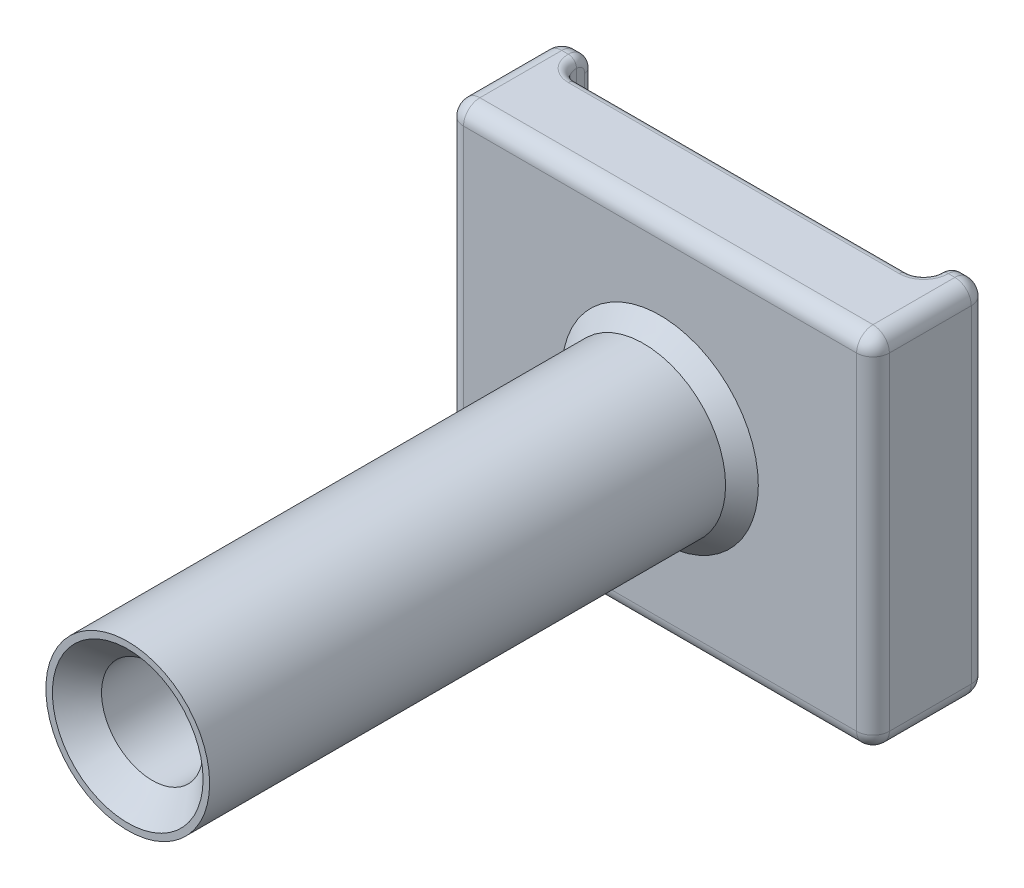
ISO-10303-21;
HEADER;
FILE_DESCRIPTION(('STEP AP214'),'2;1');
FILE_NAME('part.step','',(''),(''),'','','');
FILE_SCHEMA(('AUTOMOTIVE_DESIGN { 1 0 10303 214 1 1 1 1 }'));
ENDSEC;
DATA;
#1=APPLICATION_CONTEXT('core data for automotive mechanical design processes');
#2=APPLICATION_PROTOCOL_DEFINITION('international standard','automotive_design',2000,#1);
#3=PRODUCT_CONTEXT('',#1,'mechanical');
#4=PRODUCT('Part','Part','',(#3));
#5=PRODUCT_RELATED_PRODUCT_CATEGORY('part','',(#4));
#6=PRODUCT_DEFINITION_FORMATION('','',#4);
#7=PRODUCT_DEFINITION_CONTEXT('part definition',#1,'design');
#8=PRODUCT_DEFINITION('design','',#6,#7);
#9=PRODUCT_DEFINITION_SHAPE('','',#8);
#10=(LENGTH_UNIT() NAMED_UNIT(*) SI_UNIT(.MILLI.,.METRE.));
#11=(NAMED_UNIT(*) PLANE_ANGLE_UNIT() SI_UNIT($,.RADIAN.));
#12=(NAMED_UNIT(*) SI_UNIT($,.STERADIAN.) SOLID_ANGLE_UNIT());
#13=UNCERTAINTY_MEASURE_WITH_UNIT(LENGTH_MEASURE(1.E-05),#10,'distance_accuracy_value','');
#14=(GEOMETRIC_REPRESENTATION_CONTEXT(3) GLOBAL_UNCERTAINTY_ASSIGNED_CONTEXT((#13)) GLOBAL_UNIT_ASSIGNED_CONTEXT((#10,
#11,#12)) REPRESENTATION_CONTEXT('',''));
#15=CARTESIAN_POINT('',(0.,0.,0.));
#16=DIRECTION('',(0.,0.,1.));
#17=DIRECTION('',(1.,0.,0.));
#18=AXIS2_PLACEMENT_3D('',#15,#16,#17);
#19=CARTESIAN_POINT('',(-13.,-11.,5.));
#20=DIRECTION('',(0.,0.,1.));
#21=DIRECTION('',(1.,0.,0.));
#22=AXIS2_PLACEMENT_3D('',#19,#20,#21);
#23=PLANE('',#22);
#24=CARTESIAN_POINT('',(0.,0.,5.));
#25=DIRECTION('',(0.,0.,1.));
#26=DIRECTION('',(1.,0.,0.));
#27=AXIS2_PLACEMENT_3D('',#24,#25,#26);
#28=CIRCLE('',#27,6.);
#29=CARTESIAN_POINT('',(6.,0.,5.));
#30=VERTEX_POINT('',#29);
#31=EDGE_CURVE('E332',#30,#30,#28,.F.);
#32=ORIENTED_EDGE('',*,*,#31,.T.);
#33=EDGE_LOOP('',(#32));
#34=FACE_BOUND('',#33,.T.);
#35=DIRECTION('',(0.,1.,0.));
#36=VECTOR('',#35,1.);
#37=CARTESIAN_POINT('',(12.,11.,5.));
#38=LINE('',#37,#36);
#39=CARTESIAN_POINT('',(12.,-10.,5.));
#40=VERTEX_POINT('',#39);
#41=CARTESIAN_POINT('',(12.,10.,5.));
#42=VERTEX_POINT('',#41);
#43=EDGE_CURVE('E211',#40,#42,#38,.T.);
#44=ORIENTED_EDGE('',*,*,#43,.T.);
#45=DIRECTION('',(-1.,0.,0.));
#46=VECTOR('',#45,1.);
#47=CARTESIAN_POINT('',(-13.,10.,5.));
#48=LINE('',#47,#46);
#49=CARTESIAN_POINT('',(-12.,10.,5.));
#50=VERTEX_POINT('',#49);
#51=EDGE_CURVE('E182',#42,#50,#48,.T.);
#52=ORIENTED_EDGE('',*,*,#51,.T.);
#53=DIRECTION('',(0.,-1.,0.));
#54=VECTOR('',#53,1.);
#55=CARTESIAN_POINT('',(-12.,-11.,5.));
#56=LINE('',#55,#54);
#57=CARTESIAN_POINT('',(-12.,-10.,5.));
#58=VERTEX_POINT('',#57);
#59=EDGE_CURVE('E201',#50,#58,#56,.T.);
#60=ORIENTED_EDGE('',*,*,#59,.T.);
#61=DIRECTION('',(1.,0.,0.));
#62=VECTOR('',#61,1.);
#63=CARTESIAN_POINT('',(13.,-10.,5.));
#64=LINE('',#63,#62);
#65=EDGE_CURVE('E207',#58,#40,#64,.T.);
#66=ORIENTED_EDGE('',*,*,#65,.T.);
#67=EDGE_LOOP('',(#44,#52,#60,#66));
#68=FACE_BOUND('',#67,.T.);
#69=ADVANCED_FACE('F17',(#34,#68),#23,.T.);
#70=CARTESIAN_POINT('',(-13.,-11.,0.));
#71=DIRECTION('',(0.,0.,1.));
#72=DIRECTION('',(1.,0.,0.));
#73=AXIS2_PLACEMENT_3D('',#70,#71,#72);
#74=PLANE('',#73);
#75=CARTESIAN_POINT('',(0.,0.,0.));
#76=DIRECTION('',(0.,0.,1.));
#77=DIRECTION('',(1.,0.,0.));
#78=AXIS2_PLACEMENT_3D('',#75,#76,#77);
#79=CIRCLE('',#78,3.1);
#80=CARTESIAN_POINT('',(3.1,0.,0.));
#81=VERTEX_POINT('',#80);
#82=EDGE_CURVE('E208',#81,#81,#79,.T.);
#83=ORIENTED_EDGE('',*,*,#82,.T.);
#84=EDGE_LOOP('',(#83));
#85=FACE_BOUND('',#84,.T.);
#86=DIRECTION('',(0.,1.,0.));
#87=VECTOR('',#86,1.);
#88=CARTESIAN_POINT('',(10.1,-11.,0.));
#89=LINE('',#88,#87);
#90=CARTESIAN_POINT('',(10.1,10.5,0.));
#91=VERTEX_POINT('',#90);
#92=CARTESIAN_POINT('',(10.1,-10.5,0.));
#93=VERTEX_POINT('',#92);
#94=EDGE_CURVE('E272',#91,#93,#89,.F.);
#95=ORIENTED_EDGE('',*,*,#94,.T.);
#96=DIRECTION('',(1.,0.,0.));
#97=VECTOR('',#96,1.);
#98=CARTESIAN_POINT('',(-13.,-10.5,0.));
#99=LINE('',#98,#97);
#100=CARTESIAN_POINT('',(-10.1,-10.5,0.));
#101=VERTEX_POINT('',#100);
#102=EDGE_CURVE('E290',#93,#101,#99,.F.);
#103=ORIENTED_EDGE('',*,*,#102,.T.);
#104=DIRECTION('',(0.,-1.,0.));
#105=VECTOR('',#104,1.);
#106=CARTESIAN_POINT('',(-10.1,11.,0.));
#107=LINE('',#106,#105);
#108=CARTESIAN_POINT('',(-10.1,10.5,0.));
#109=VERTEX_POINT('',#108);
#110=EDGE_CURVE('E275',#101,#109,#107,.F.);
#111=ORIENTED_EDGE('',*,*,#110,.T.);
#112=DIRECTION('',(-1.,0.,0.));
#113=VECTOR('',#112,1.);
#114=CARTESIAN_POINT('',(-13.,10.5,0.));
#115=LINE('',#114,#113);
#116=EDGE_CURVE('E288',#109,#91,#115,.F.);
#117=ORIENTED_EDGE('',*,*,#116,.T.);
#118=EDGE_LOOP('',(#95,#103,#111,#117));
#119=FACE_BOUND('',#118,.T.);
#120=ADVANCED_FACE('F355',(#85,#119),#74,.F.);
#121=CARTESIAN_POINT('',(-13.,11.,5.));
#122=DIRECTION('',(1.,0.,0.));
#123=DIRECTION('',(0.,1.,0.));
#124=AXIS2_PLACEMENT_3D('',#121,#122,#123);
#125=PLANE('',#124);
#126=DIRECTION('',(0.,0.,-1.));
#127=VECTOR('',#126,1.);
#128=CARTESIAN_POINT('',(-13.,-10.,5.));
#129=LINE('',#128,#127);
#130=CARTESIAN_POINT('',(-13.,-10.,-1.));
#131=VERTEX_POINT('',#130);
#132=CARTESIAN_POINT('',(-13.,-10.,4.));
#133=VERTEX_POINT('',#132);
#134=EDGE_CURVE('E248',#131,#133,#129,.F.);
#135=ORIENTED_EDGE('',*,*,#134,.T.);
#136=DIRECTION('',(0.,-1.,0.));
#137=VECTOR('',#136,1.);
#138=CARTESIAN_POINT('',(-13.,11.,4.));
#139=LINE('',#138,#137);
#140=CARTESIAN_POINT('',(-13.,10.,4.));
#141=VERTEX_POINT('',#140);
#142=EDGE_CURVE('E252',#133,#141,#139,.F.);
#143=ORIENTED_EDGE('',*,*,#142,.T.);
#144=DIRECTION('',(0.,0.,-1.));
#145=VECTOR('',#144,1.);
#146=CARTESIAN_POINT('',(-13.,10.,5.));
#147=LINE('',#146,#145);
#148=CARTESIAN_POINT('',(-13.,10.,-1.));
#149=VERTEX_POINT('',#148);
#150=EDGE_CURVE('E250',#141,#149,#147,.T.);
#151=ORIENTED_EDGE('',*,*,#150,.T.);
#152=DIRECTION('',(0.,1.,0.));
#153=VECTOR('',#152,1.);
#154=CARTESIAN_POINT('',(-13.,-11.,-1.));
#155=LINE('',#154,#153);
#156=EDGE_CURVE('E246',#149,#131,#155,.F.);
#157=ORIENTED_EDGE('',*,*,#156,.T.);
#158=EDGE_LOOP('',(#135,#143,#151,#157));
#159=FACE_BOUND('',#158,.T.);
#160=ADVANCED_FACE('F19',(#159),#125,.F.);
#161=CARTESIAN_POINT('',(-13.,-11.,5.));
#162=DIRECTION('',(0.,1.,0.));
#163=DIRECTION('',(-1.,0.,0.));
#164=AXIS2_PLACEMENT_3D('',#161,#162,#163);
#165=PLANE('',#164);
#166=DIRECTION('',(1.,0.,0.));
#167=VECTOR('',#166,1.);
#168=CARTESIAN_POINT('',(-13.,-11.,0.5));
#169=LINE('',#168,#167);
#170=CARTESIAN_POINT('',(-10.1,-11.,0.5));
#171=VERTEX_POINT('',#170);
#172=CARTESIAN_POINT('',(10.1,-11.,0.5));
#173=VERTEX_POINT('',#172);
#174=EDGE_CURVE('E283',#171,#173,#169,.T.);
#175=ORIENTED_EDGE('',*,*,#174,.T.);
#176=CARTESIAN_POINT('',(10.1,-11.,-1.));
#177=DIRECTION('',(0.,1.,0.));
#178=DIRECTION('',(-1.,0.,0.));
#179=AXIS2_PLACEMENT_3D('',#176,#177,#178);
#180=CIRCLE('',#179,1.5);
#181=CARTESIAN_POINT('',(11.6,-11.,-1.));
#182=VERTEX_POINT('',#181);
#183=EDGE_CURVE('E286',#173,#182,#180,.T.);
#184=ORIENTED_EDGE('',*,*,#183,.T.);
#185=DIRECTION('',(-1.,0.,0.));
#186=VECTOR('',#185,1.);
#187=CARTESIAN_POINT('',(13.,-11.,-1.));
#188=LINE('',#187,#186);
#189=CARTESIAN_POINT('',(12.,-11.,-1.));
#190=VERTEX_POINT('',#189);
#191=EDGE_CURVE('E244',#182,#190,#188,.F.);
#192=ORIENTED_EDGE('',*,*,#191,.T.);
#193=DIRECTION('',(0.,0.,-1.));
#194=VECTOR('',#193,1.);
#195=CARTESIAN_POINT('',(12.,-11.,5.));
#196=LINE('',#195,#194);
#197=CARTESIAN_POINT('',(12.,-11.,4.));
#198=VERTEX_POINT('',#197);
#199=EDGE_CURVE('E242',#190,#198,#196,.F.);
#200=ORIENTED_EDGE('',*,*,#199,.T.);
#201=DIRECTION('',(1.,0.,0.));
#202=VECTOR('',#201,1.);
#203=CARTESIAN_POINT('',(-13.,-11.,4.));
#204=LINE('',#203,#202);
#205=CARTESIAN_POINT('',(-12.,-11.,4.));
#206=VERTEX_POINT('',#205);
#207=EDGE_CURVE('E240',#198,#206,#204,.F.);
#208=ORIENTED_EDGE('',*,*,#207,.T.);
#209=DIRECTION('',(0.,0.,-1.));
#210=VECTOR('',#209,1.);
#211=CARTESIAN_POINT('',(-12.,-11.,5.));
#212=LINE('',#211,#210);
#213=CARTESIAN_POINT('',(-12.,-11.,-1.));
#214=VERTEX_POINT('',#213);
#215=EDGE_CURVE('E235',#206,#214,#212,.T.);
#216=ORIENTED_EDGE('',*,*,#215,.T.);
#217=DIRECTION('',(-1.,0.,0.));
#218=VECTOR('',#217,1.);
#219=CARTESIAN_POINT('',(-11.1,-11.,-1.));
#220=LINE('',#219,#218);
#221=CARTESIAN_POINT('',(-11.6,-11.,-1.));
#222=VERTEX_POINT('',#221);
#223=EDGE_CURVE('E237',#214,#222,#220,.F.);
#224=ORIENTED_EDGE('',*,*,#223,.T.);
#225=CARTESIAN_POINT('',(-10.1,-11.,-1.));
#226=DIRECTION('',(0.,1.,0.));
#227=DIRECTION('',(-1.,0.,0.));
#228=AXIS2_PLACEMENT_3D('',#225,#226,#227);
#229=CIRCLE('',#228,1.5);
#230=EDGE_CURVE('E281',#222,#171,#229,.T.);
#231=ORIENTED_EDGE('',*,*,#230,.T.);
#232=EDGE_LOOP('',(#175,#184,#192,#200,#208,#216,#224,#231));
#233=FACE_BOUND('',#232,.T.);
#234=ADVANCED_FACE('F371',(#233),#165,.F.);
#235=CARTESIAN_POINT('',(13.,11.,5.));
#236=DIRECTION('',(-1.,0.,0.));
#237=DIRECTION('',(0.,0.,1.));
#238=AXIS2_PLACEMENT_3D('',#235,#236,#237);
#239=PLANE('',#238);
#240=DIRECTION('',(0.,0.,-1.));
#241=VECTOR('',#240,1.);
#242=CARTESIAN_POINT('',(13.,10.,5.));
#243=LINE('',#242,#241);
#244=CARTESIAN_POINT('',(13.,10.,-1.));
#245=VERTEX_POINT('',#244);
#246=CARTESIAN_POINT('',(13.,10.,4.));
#247=VERTEX_POINT('',#246);
#248=EDGE_CURVE('E230',#245,#247,#243,.F.);
#249=ORIENTED_EDGE('',*,*,#248,.T.);
#250=DIRECTION('',(0.,1.,0.));
#251=VECTOR('',#250,1.);
#252=CARTESIAN_POINT('',(13.,-11.,4.));
#253=LINE('',#252,#251);
#254=CARTESIAN_POINT('',(13.,-10.,4.));
#255=VERTEX_POINT('',#254);
#256=EDGE_CURVE('E232',#247,#255,#253,.F.);
#257=ORIENTED_EDGE('',*,*,#256,.T.);
#258=DIRECTION('',(0.,0.,-1.));
#259=VECTOR('',#258,1.);
#260=CARTESIAN_POINT('',(13.,-10.,5.));
#261=LINE('',#260,#259);
#262=CARTESIAN_POINT('',(13.,-10.,-1.));
#263=VERTEX_POINT('',#262);
#264=EDGE_CURVE('E228',#255,#263,#261,.T.);
#265=ORIENTED_EDGE('',*,*,#264,.T.);
#266=DIRECTION('',(0.,-1.,0.));
#267=VECTOR('',#266,1.);
#268=CARTESIAN_POINT('',(13.,11.,-1.));
#269=LINE('',#268,#267);
#270=EDGE_CURVE('E226',#263,#245,#269,.F.);
#271=ORIENTED_EDGE('',*,*,#270,.T.);
#272=EDGE_LOOP('',(#249,#257,#265,#271));
#273=FACE_BOUND('',#272,.T.);
#274=ADVANCED_FACE('F369',(#273),#239,.F.);
#275=CARTESIAN_POINT('',(-13.,11.,5.));
#276=DIRECTION('',(0.,-1.,0.));
#277=DIRECTION('',(1.,0.,0.));
#278=AXIS2_PLACEMENT_3D('',#275,#276,#277);
#279=PLANE('',#278);
#280=DIRECTION('',(1.,0.,0.));
#281=VECTOR('',#280,1.);
#282=CARTESIAN_POINT('',(11.1,11.,-1.));
#283=LINE('',#282,#281);
#284=CARTESIAN_POINT('',(12.,11.,-1.));
#285=VERTEX_POINT('',#284);
#286=CARTESIAN_POINT('',(11.6,11.,-1.));
#287=VERTEX_POINT('',#286);
#288=EDGE_CURVE('E224',#285,#287,#283,.F.);
#289=ORIENTED_EDGE('',*,*,#288,.T.);
#290=CARTESIAN_POINT('',(10.1,11.,-1.));
#291=DIRECTION('',(0.,-1.,0.));
#292=DIRECTION('',(1.,0.,0.));
#293=AXIS2_PLACEMENT_3D('',#290,#291,#292);
#294=CIRCLE('',#293,1.5);
#295=CARTESIAN_POINT('',(10.1,11.,0.5));
#296=VERTEX_POINT('',#295);
#297=EDGE_CURVE('E37',#287,#296,#294,.T.);
#298=ORIENTED_EDGE('',*,*,#297,.T.);
#299=DIRECTION('',(-1.,0.,0.));
#300=VECTOR('',#299,1.);
#301=CARTESIAN_POINT('',(-13.,11.,0.5));
#302=LINE('',#301,#300);
#303=CARTESIAN_POINT('',(-10.1,11.,0.5));
#304=VERTEX_POINT('',#303);
#305=EDGE_CURVE('E32',#296,#304,#302,.T.);
#306=ORIENTED_EDGE('',*,*,#305,.T.);
#307=CARTESIAN_POINT('',(-10.1,11.,-1.));
#308=DIRECTION('',(0.,-1.,0.));
#309=DIRECTION('',(1.,0.,0.));
#310=AXIS2_PLACEMENT_3D('',#307,#308,#309);
#311=CIRCLE('',#310,1.5);
#312=CARTESIAN_POINT('',(-11.6,11.,-1.));
#313=VERTEX_POINT('',#312);
#314=EDGE_CURVE('E326',#304,#313,#311,.T.);
#315=ORIENTED_EDGE('',*,*,#314,.T.);
#316=DIRECTION('',(1.,0.,0.));
#317=VECTOR('',#316,1.);
#318=CARTESIAN_POINT('',(-13.,11.,-1.));
#319=LINE('',#318,#317);
#320=CARTESIAN_POINT('',(-12.,11.,-1.));
#321=VERTEX_POINT('',#320);
#322=EDGE_CURVE('E215',#313,#321,#319,.F.);
#323=ORIENTED_EDGE('',*,*,#322,.T.);
#324=DIRECTION('',(0.,0.,-1.));
#325=VECTOR('',#324,1.);
#326=CARTESIAN_POINT('',(-12.,11.,5.));
#327=LINE('',#326,#325);
#328=CARTESIAN_POINT('',(-12.,11.,4.));
#329=VERTEX_POINT('',#328);
#330=EDGE_CURVE('E213',#321,#329,#327,.F.);
#331=ORIENTED_EDGE('',*,*,#330,.T.);
#332=DIRECTION('',(-1.,0.,0.));
#333=VECTOR('',#332,1.);
#334=CARTESIAN_POINT('',(13.,11.,4.));
#335=LINE('',#334,#333);
#336=CARTESIAN_POINT('',(12.,11.,4.));
#337=VERTEX_POINT('',#336);
#338=EDGE_CURVE('E184',#329,#337,#335,.F.);
#339=ORIENTED_EDGE('',*,*,#338,.T.);
#340=DIRECTION('',(0.,0.,-1.));
#341=VECTOR('',#340,1.);
#342=CARTESIAN_POINT('',(12.,11.,5.));
#343=LINE('',#342,#341);
#344=EDGE_CURVE('E222',#337,#285,#343,.T.);
#345=ORIENTED_EDGE('',*,*,#344,.T.);
#346=EDGE_LOOP('',(#289,#298,#306,#315,#323,#331,#339,#345));
#347=FACE_BOUND('',#346,.T.);
#348=ADVANCED_FACE('F366',(#347),#279,.F.);
#349=CARTESIAN_POINT('',(0.,0.,5.));
#350=DIRECTION('',(0.,0.,-1.));
#351=DIRECTION('',(-1.,0.,0.));
#352=AXIS2_PLACEMENT_3D('',#349,#350,#351);
#353=CYLINDRICAL_SURFACE('',#352,3.1);
#354=CARTESIAN_POINT('',(0.,0.,36.));
#355=DIRECTION('',(0.,0.,1.));
#356=DIRECTION('',(1.,0.,0.));
#357=AXIS2_PLACEMENT_3D('',#354,#355,#356);
#358=CIRCLE('',#357,3.1);
#359=CARTESIAN_POINT('',(3.1,0.,36.));
#360=VERTEX_POINT('',#359);
#361=EDGE_CURVE('E25',#360,#360,#358,.T.);
#362=ORIENTED_EDGE('',*,*,#361,.T.);
#363=EDGE_LOOP('',(#362));
#364=FACE_BOUND('',#363,.T.);
#365=ORIENTED_EDGE('',*,*,#82,.F.);
#366=EDGE_LOOP('',(#365));
#367=FACE_BOUND('',#366,.T.);
#368=ADVANCED_FACE('F337',(#364,#367),#353,.F.);
#369=CARTESIAN_POINT('',(-11.1,11.,-2.));
#370=DIRECTION('',(-1.,0.,0.));
#371=DIRECTION('',(0.,-1.,0.));
#372=AXIS2_PLACEMENT_3D('',#369,#370,#371);
#373=PLANE('',#372);
#374=DIRECTION('',(0.,-1.,0.));
#375=VECTOR('',#374,1.);
#376=CARTESIAN_POINT('',(-11.1,-11.,-1.));
#377=LINE('',#376,#375);
#378=CARTESIAN_POINT('',(-11.1,10.5,-1.));
#379=VERTEX_POINT('',#378);
#380=CARTESIAN_POINT('',(-11.1,-10.5,-1.));
#381=VERTEX_POINT('',#380);
#382=EDGE_CURVE('E269',#379,#381,#377,.T.);
#383=ORIENTED_EDGE('',*,*,#382,.T.);
#384=CARTESIAN_POINT('',(-11.1,-10.,-1.));
#385=DIRECTION('',(-1.,0.,0.));
#386=DIRECTION('',(0.,-1.,0.));
#387=AXIS2_PLACEMENT_3D('',#384,#385,#386);
#388=CIRCLE('',#387,0.5);
#389=CARTESIAN_POINT('',(-11.1,-10.,-1.5));
#390=VERTEX_POINT('',#389);
#391=EDGE_CURVE('E313',#381,#390,#388,.F.);
#392=ORIENTED_EDGE('',*,*,#391,.T.);
#393=DIRECTION('',(0.,-1.,0.));
#394=VECTOR('',#393,1.);
#395=CARTESIAN_POINT('',(-11.1,10.,-1.5));
#396=LINE('',#395,#394);
#397=CARTESIAN_POINT('',(-11.1,10.,-1.5));
#398=VERTEX_POINT('',#397);
#399=EDGE_CURVE('E311',#390,#398,#396,.F.);
#400=ORIENTED_EDGE('',*,*,#399,.T.);
#401=CARTESIAN_POINT('',(-11.1,10.,-1.));
#402=DIRECTION('',(-1.,0.,0.));
#403=DIRECTION('',(0.,-1.,0.));
#404=AXIS2_PLACEMENT_3D('',#401,#402,#403);
#405=CIRCLE('',#404,0.5);
#406=EDGE_CURVE('E309',#398,#379,#405,.F.);
#407=ORIENTED_EDGE('',*,*,#406,.T.);
#408=EDGE_LOOP('',(#383,#392,#400,#407));
#409=FACE_BOUND('',#408,.T.);
#410=ADVANCED_FACE('F596',(#409),#373,.F.);
#411=CARTESIAN_POINT('',(-13.,11.,-2.));
#412=DIRECTION('',(0.,0.,-1.));
#413=DIRECTION('',(-1.,0.,0.));
#414=AXIS2_PLACEMENT_3D('',#411,#412,#413);
#415=PLANE('',#414);
#416=DIRECTION('',(1.,0.,0.));
#417=VECTOR('',#416,1.);
#418=CARTESIAN_POINT('',(-11.1,10.,-2.));
#419=LINE('',#418,#417);
#420=CARTESIAN_POINT('',(-12.,10.,-2.));
#421=VERTEX_POINT('',#420);
#422=CARTESIAN_POINT('',(-11.6,10.,-2.));
#423=VERTEX_POINT('',#422);
#424=EDGE_CURVE('E259',#421,#423,#419,.T.);
#425=ORIENTED_EDGE('',*,*,#424,.T.);
#426=DIRECTION('',(0.,-1.,0.));
#427=VECTOR('',#426,1.);
#428=CARTESIAN_POINT('',(-11.6,-10.,-2.));
#429=LINE('',#428,#427);
#430=CARTESIAN_POINT('',(-11.6,-10.,-2.));
#431=VERTEX_POINT('',#430);
#432=EDGE_CURVE('E319',#423,#431,#429,.T.);
#433=ORIENTED_EDGE('',*,*,#432,.T.);
#434=DIRECTION('',(-1.,0.,0.));
#435=VECTOR('',#434,1.);
#436=CARTESIAN_POINT('',(-13.,-10.,-2.));
#437=LINE('',#436,#435);
#438=CARTESIAN_POINT('',(-12.,-10.,-2.));
#439=VERTEX_POINT('',#438);
#440=EDGE_CURVE('E257',#431,#439,#437,.T.);
#441=ORIENTED_EDGE('',*,*,#440,.T.);
#442=DIRECTION('',(0.,1.,0.));
#443=VECTOR('',#442,1.);
#444=CARTESIAN_POINT('',(-12.,11.,-2.));
#445=LINE('',#444,#443);
#446=EDGE_CURVE('E255',#439,#421,#445,.T.);
#447=ORIENTED_EDGE('',*,*,#446,.T.);
#448=EDGE_LOOP('',(#425,#433,#441,#447));
#449=FACE_BOUND('',#448,.T.);
#450=ADVANCED_FACE('F592',(#449),#415,.T.);
#451=CARTESIAN_POINT('',(11.1,-11.,-2.));
#452=DIRECTION('',(1.,0.,0.));
#453=DIRECTION('',(0.,0.,-1.));
#454=AXIS2_PLACEMENT_3D('',#451,#452,#453);
#455=PLANE('',#454);
#456=DIRECTION('',(0.,1.,0.));
#457=VECTOR('',#456,1.);
#458=CARTESIAN_POINT('',(11.1,-10.,-1.5));
#459=LINE('',#458,#457);
#460=CARTESIAN_POINT('',(11.1,10.,-1.5));
#461=VERTEX_POINT('',#460);
#462=CARTESIAN_POINT('',(11.1,-10.,-1.5));
#463=VERTEX_POINT('',#462);
#464=EDGE_CURVE('E303',#461,#463,#459,.F.);
#465=ORIENTED_EDGE('',*,*,#464,.T.);
#466=CARTESIAN_POINT('',(11.1,-10.,-1.));
#467=DIRECTION('',(1.,0.,0.));
#468=DIRECTION('',(0.,0.,-1.));
#469=AXIS2_PLACEMENT_3D('',#466,#467,#468);
#470=CIRCLE('',#469,0.5);
#471=CARTESIAN_POINT('',(11.1,-10.5,-1.));
#472=VERTEX_POINT('',#471);
#473=EDGE_CURVE('E305',#463,#472,#470,.F.);
#474=ORIENTED_EDGE('',*,*,#473,.T.);
#475=DIRECTION('',(0.,1.,0.));
#476=VECTOR('',#475,1.);
#477=CARTESIAN_POINT('',(11.1,11.,-1.));
#478=LINE('',#477,#476);
#479=CARTESIAN_POINT('',(11.1,10.5,-1.));
#480=VERTEX_POINT('',#479);
#481=EDGE_CURVE('E278',#472,#480,#478,.T.);
#482=ORIENTED_EDGE('',*,*,#481,.T.);
#483=CARTESIAN_POINT('',(11.1,10.,-1.));
#484=DIRECTION('',(1.,0.,0.));
#485=DIRECTION('',(0.,0.,-1.));
#486=AXIS2_PLACEMENT_3D('',#483,#484,#485);
#487=CIRCLE('',#486,0.5);
#488=EDGE_CURVE('E301',#480,#461,#487,.F.);
#489=ORIENTED_EDGE('',*,*,#488,.T.);
#490=EDGE_LOOP('',(#465,#474,#482,#489));
#491=FACE_BOUND('',#490,.T.);
#492=ADVANCED_FACE('F588',(#491),#455,.F.);
#493=CARTESIAN_POINT('',(11.1,-11.,-2.));
#494=DIRECTION('',(0.,0.,-1.));
#495=DIRECTION('',(-1.,0.,0.));
#496=AXIS2_PLACEMENT_3D('',#493,#494,#495);
#497=PLANE('',#496);
#498=DIRECTION('',(-1.,0.,0.));
#499=VECTOR('',#498,1.);
#500=CARTESIAN_POINT('',(11.1,-10.,-2.));
#501=LINE('',#500,#499);
#502=CARTESIAN_POINT('',(12.,-10.,-2.));
#503=VERTEX_POINT('',#502);
#504=CARTESIAN_POINT('',(11.6,-10.,-2.));
#505=VERTEX_POINT('',#504);
#506=EDGE_CURVE('E266',#503,#505,#501,.T.);
#507=ORIENTED_EDGE('',*,*,#506,.T.);
#508=DIRECTION('',(0.,1.,0.));
#509=VECTOR('',#508,1.);
#510=CARTESIAN_POINT('',(11.6,10.,-2.));
#511=LINE('',#510,#509);
#512=CARTESIAN_POINT('',(11.6,10.,-2.));
#513=VERTEX_POINT('',#512);
#514=EDGE_CURVE('E317',#505,#513,#511,.T.);
#515=ORIENTED_EDGE('',*,*,#514,.T.);
#516=DIRECTION('',(1.,0.,0.));
#517=VECTOR('',#516,1.);
#518=CARTESIAN_POINT('',(13.,10.,-2.));
#519=LINE('',#518,#517);
#520=CARTESIAN_POINT('',(12.,10.,-2.));
#521=VERTEX_POINT('',#520);
#522=EDGE_CURVE('E264',#513,#521,#519,.T.);
#523=ORIENTED_EDGE('',*,*,#522,.T.);
#524=DIRECTION('',(0.,-1.,0.));
#525=VECTOR('',#524,1.);
#526=CARTESIAN_POINT('',(12.,-11.,-2.));
#527=LINE('',#526,#525);
#528=EDGE_CURVE('E262',#521,#503,#527,.T.);
#529=ORIENTED_EDGE('',*,*,#528,.T.);
#530=EDGE_LOOP('',(#507,#515,#523,#529));
#531=FACE_BOUND('',#530,.T.);
#532=ADVANCED_FACE('F584',(#531),#497,.T.);
#533=CARTESIAN_POINT('',(11.1,-10.,-1.));
#534=DIRECTION('',(1.,0.,0.));
#535=DIRECTION('',(0.,1.,0.));
#536=AXIS2_PLACEMENT_3D('',#533,#534,#535);
#537=CYLINDRICAL_SURFACE('',#536,1.);
#538=ORIENTED_EDGE('',*,*,#191,.F.);
#539=CARTESIAN_POINT('',(11.6,-10.,-1.));
#540=DIRECTION('',(1.,0.,0.));
#541=DIRECTION('',(0.,0.,-1.));
#542=AXIS2_PLACEMENT_3D('',#539,#540,#541);
#543=CIRCLE('',#542,1.);
#544=EDGE_CURVE('E307',#182,#505,#543,.T.);
#545=ORIENTED_EDGE('',*,*,#544,.T.);
#546=ORIENTED_EDGE('',*,*,#506,.F.);
#547=CARTESIAN_POINT('',(12.,-10.,-1.));
#548=DIRECTION('',(1.,0.,0.));
#549=DIRECTION('',(0.,0.,-1.));
#550=AXIS2_PLACEMENT_3D('',#547,#548,#549);
#551=CIRCLE('',#550,1.);
#552=EDGE_CURVE('E487',#190,#503,#551,.T.);
#553=ORIENTED_EDGE('',*,*,#552,.F.);
#554=EDGE_LOOP('',(#538,#545,#546,#553));
#555=FACE_BOUND('',#554,.T.);
#556=ADVANCED_FACE('F580',(#555),#537,.T.);
#557=CARTESIAN_POINT('',(-13.,-10.,-1.));
#558=DIRECTION('',(1.,0.,0.));
#559=DIRECTION('',(0.,1.,0.));
#560=AXIS2_PLACEMENT_3D('',#557,#558,#559);
#561=CYLINDRICAL_SURFACE('',#560,1.);
#562=ORIENTED_EDGE('',*,*,#440,.F.);
#563=CARTESIAN_POINT('',(-11.6,-10.,-1.));
#564=DIRECTION('',(-1.,0.,0.));
#565=DIRECTION('',(0.,-1.,0.));
#566=AXIS2_PLACEMENT_3D('',#563,#564,#565);
#567=CIRCLE('',#566,1.);
#568=EDGE_CURVE('E315',#431,#222,#567,.T.);
#569=ORIENTED_EDGE('',*,*,#568,.T.);
#570=ORIENTED_EDGE('',*,*,#223,.F.);
#571=CARTESIAN_POINT('',(-12.,-10.,-1.));
#572=DIRECTION('',(-1.,0.,0.));
#573=DIRECTION('',(0.,0.,1.));
#574=AXIS2_PLACEMENT_3D('',#571,#572,#573);
#575=CIRCLE('',#574,1.);
#576=EDGE_CURVE('E484',#439,#214,#575,.T.);
#577=ORIENTED_EDGE('',*,*,#576,.F.);
#578=EDGE_LOOP('',(#562,#569,#570,#577));
#579=FACE_BOUND('',#578,.T.);
#580=ADVANCED_FACE('F576',(#579),#561,.T.);
#581=CARTESIAN_POINT('',(12.,-10.,-1.));
#582=DIRECTION('',(0.,0.,1.));
#583=DIRECTION('',(1.,0.,0.));
#584=AXIS2_PLACEMENT_3D('',#581,#582,#583);
#585=SPHERICAL_SURFACE('',#584,1.);
#586=CARTESIAN_POINT('',(12.,-10.,-1.));
#587=DIRECTION('',(0.,0.,-1.));
#588=DIRECTION('',(-1.,0.,0.));
#589=AXIS2_PLACEMENT_3D('',#586,#587,#588);
#590=CIRCLE('',#589,1.);
#591=EDGE_CURVE('E478',#190,#263,#590,.F.);
#592=ORIENTED_EDGE('',*,*,#591,.F.);
#593=ORIENTED_EDGE('',*,*,#552,.T.);
#594=CARTESIAN_POINT('',(12.,-10.,-1.));
#595=DIRECTION('',(0.,-1.,0.));
#596=DIRECTION('',(1.,0.,0.));
#597=AXIS2_PLACEMENT_3D('',#594,#595,#596);
#598=CIRCLE('',#597,1.);
#599=EDGE_CURVE('E481',#263,#503,#598,.F.);
#600=ORIENTED_EDGE('',*,*,#599,.F.);
#601=EDGE_LOOP('',(#592,#593,#600));
#602=FACE_BOUND('',#601,.T.);
#603=ADVANCED_FACE('F572',(#602),#585,.T.);
#604=CARTESIAN_POINT('',(-12.,-10.,-1.));
#605=DIRECTION('',(0.,0.,1.));
#606=DIRECTION('',(1.,0.,0.));
#607=AXIS2_PLACEMENT_3D('',#604,#605,#606);
#608=SPHERICAL_SURFACE('',#607,1.);
#609=CARTESIAN_POINT('',(-12.,-10.,-1.));
#610=DIRECTION('',(0.,-1.,0.));
#611=DIRECTION('',(0.,0.,-1.));
#612=AXIS2_PLACEMENT_3D('',#609,#610,#611);
#613=CIRCLE('',#612,1.);
#614=EDGE_CURVE('E472',#439,#131,#613,.F.);
#615=ORIENTED_EDGE('',*,*,#614,.F.);
#616=ORIENTED_EDGE('',*,*,#576,.T.);
#617=CARTESIAN_POINT('',(-12.,-10.,-1.));
#618=DIRECTION('',(0.,0.,-1.));
#619=DIRECTION('',(-1.,0.,0.));
#620=AXIS2_PLACEMENT_3D('',#617,#618,#619);
#621=CIRCLE('',#620,1.);
#622=EDGE_CURVE('E475',#131,#214,#621,.F.);
#623=ORIENTED_EDGE('',*,*,#622,.F.);
#624=EDGE_LOOP('',(#615,#616,#623));
#625=FACE_BOUND('',#624,.T.);
#626=ADVANCED_FACE('F568',(#625),#608,.T.);
#627=CARTESIAN_POINT('',(11.1,10.,-1.));
#628=DIRECTION('',(-1.,0.,0.));
#629=DIRECTION('',(0.,-1.,0.));
#630=AXIS2_PLACEMENT_3D('',#627,#628,#629);
#631=CYLINDRICAL_SURFACE('',#630,1.);
#632=ORIENTED_EDGE('',*,*,#522,.F.);
#633=CARTESIAN_POINT('',(11.6,10.,-1.));
#634=DIRECTION('',(1.,0.,0.));
#635=DIRECTION('',(0.,0.,-1.));
#636=AXIS2_PLACEMENT_3D('',#633,#634,#635);
#637=CIRCLE('',#636,1.);
#638=EDGE_CURVE('E321',#513,#287,#637,.T.);
#639=ORIENTED_EDGE('',*,*,#638,.T.);
#640=ORIENTED_EDGE('',*,*,#288,.F.);
#641=CARTESIAN_POINT('',(12.,10.,-1.));
#642=DIRECTION('',(1.,0.,0.));
#643=DIRECTION('',(0.,1.,0.));
#644=AXIS2_PLACEMENT_3D('',#641,#642,#643);
#645=CIRCLE('',#644,1.);
#646=EDGE_CURVE('E469',#521,#285,#645,.T.);
#647=ORIENTED_EDGE('',*,*,#646,.F.);
#648=EDGE_LOOP('',(#632,#639,#640,#647));
#649=FACE_BOUND('',#648,.T.);
#650=ADVANCED_FACE('F564',(#649),#631,.T.);
#651=CARTESIAN_POINT('',(12.,-11.,-1.));
#652=DIRECTION('',(0.,1.,0.));
#653=DIRECTION('',(0.,0.,1.));
#654=AXIS2_PLACEMENT_3D('',#651,#652,#653);
#655=CYLINDRICAL_SURFACE('',#654,1.);
#656=ORIENTED_EDGE('',*,*,#599,.T.);
#657=ORIENTED_EDGE('',*,*,#528,.F.);
#658=CARTESIAN_POINT('',(12.,10.,-1.));
#659=DIRECTION('',(0.,1.,0.));
#660=DIRECTION('',(0.,0.,1.));
#661=AXIS2_PLACEMENT_3D('',#658,#659,#660);
#662=CIRCLE('',#661,1.);
#663=EDGE_CURVE('E466',#245,#521,#662,.T.);
#664=ORIENTED_EDGE('',*,*,#663,.F.);
#665=ORIENTED_EDGE('',*,*,#270,.F.);
#666=EDGE_LOOP('',(#656,#657,#664,#665));
#667=FACE_BOUND('',#666,.T.);
#668=ADVANCED_FACE('F560',(#667),#655,.T.);
#669=CARTESIAN_POINT('',(12.,-10.,5.));
#670=DIRECTION('',(0.,0.,-1.));
#671=DIRECTION('',(-1.,0.,0.));
#672=AXIS2_PLACEMENT_3D('',#669,#670,#671);
#673=CYLINDRICAL_SURFACE('',#672,1.);
#674=ORIENTED_EDGE('',*,*,#591,.T.);
#675=ORIENTED_EDGE('',*,*,#264,.F.);
#676=CARTESIAN_POINT('',(12.,-10.,4.));
#677=DIRECTION('',(0.,0.,1.));
#678=DIRECTION('',(1.,0.,0.));
#679=AXIS2_PLACEMENT_3D('',#676,#677,#678);
#680=CIRCLE('',#679,1.);
#681=EDGE_CURVE('E463',#198,#255,#680,.T.);
#682=ORIENTED_EDGE('',*,*,#681,.F.);
#683=ORIENTED_EDGE('',*,*,#199,.F.);
#684=EDGE_LOOP('',(#674,#675,#682,#683));
#685=FACE_BOUND('',#684,.T.);
#686=ADVANCED_FACE('F557',(#685),#673,.T.);
#687=CARTESIAN_POINT('',(-13.,-10.,4.));
#688=DIRECTION('',(-1.,0.,0.));
#689=DIRECTION('',(0.,-1.,0.));
#690=AXIS2_PLACEMENT_3D('',#687,#688,#689);
#691=CYLINDRICAL_SURFACE('',#690,1.);
#692=CARTESIAN_POINT('',(-12.,-10.,4.));
#693=DIRECTION('',(-1.,0.,0.));
#694=DIRECTION('',(0.,0.,1.));
#695=AXIS2_PLACEMENT_3D('',#692,#693,#694);
#696=CIRCLE('',#695,1.);
#697=EDGE_CURVE('E457',#206,#58,#696,.T.);
#698=ORIENTED_EDGE('',*,*,#697,.F.);
#699=ORIENTED_EDGE('',*,*,#207,.F.);
#700=CARTESIAN_POINT('',(12.,-10.,4.));
#701=DIRECTION('',(1.,0.,0.));
#702=DIRECTION('',(0.,1.,0.));
#703=AXIS2_PLACEMENT_3D('',#700,#701,#702);
#704=CIRCLE('',#703,1.);
#705=EDGE_CURVE('E460',#40,#198,#704,.T.);
#706=ORIENTED_EDGE('',*,*,#705,.F.);
#707=ORIENTED_EDGE('',*,*,#65,.F.);
#708=EDGE_LOOP('',(#698,#699,#706,#707));
#709=FACE_BOUND('',#708,.T.);
#710=ADVANCED_FACE('F496',(#709),#691,.T.);
#711=CARTESIAN_POINT('',(-12.,-10.,5.));
#712=DIRECTION('',(0.,0.,-1.));
#713=DIRECTION('',(-1.,0.,0.));
#714=AXIS2_PLACEMENT_3D('',#711,#712,#713);
#715=CYLINDRICAL_SURFACE('',#714,1.);
#716=ORIENTED_EDGE('',*,*,#622,.T.);
#717=ORIENTED_EDGE('',*,*,#215,.F.);
#718=CARTESIAN_POINT('',(-12.,-10.,4.));
#719=DIRECTION('',(0.,0.,1.));
#720=DIRECTION('',(1.,0.,0.));
#721=AXIS2_PLACEMENT_3D('',#718,#719,#720);
#722=CIRCLE('',#721,1.);
#723=EDGE_CURVE('E454',#133,#206,#722,.T.);
#724=ORIENTED_EDGE('',*,*,#723,.F.);
#725=ORIENTED_EDGE('',*,*,#134,.F.);
#726=EDGE_LOOP('',(#716,#717,#724,#725));
#727=FACE_BOUND('',#726,.T.);
#728=ADVANCED_FACE('F525',(#727),#715,.T.);
#729=CARTESIAN_POINT('',(-12.,11.,-1.));
#730=DIRECTION('',(0.,-1.,0.));
#731=DIRECTION('',(1.,0.,0.));
#732=AXIS2_PLACEMENT_3D('',#729,#730,#731);
#733=CYLINDRICAL_SURFACE('',#732,1.);
#734=ORIENTED_EDGE('',*,*,#614,.T.);
#735=ORIENTED_EDGE('',*,*,#156,.F.);
#736=CARTESIAN_POINT('',(-12.,10.,-1.));
#737=DIRECTION('',(0.,1.,0.));
#738=DIRECTION('',(0.,0.,1.));
#739=AXIS2_PLACEMENT_3D('',#736,#737,#738);
#740=CIRCLE('',#739,1.);
#741=EDGE_CURVE('E451',#421,#149,#740,.T.);
#742=ORIENTED_EDGE('',*,*,#741,.F.);
#743=ORIENTED_EDGE('',*,*,#446,.F.);
#744=EDGE_LOOP('',(#734,#735,#742,#743));
#745=FACE_BOUND('',#744,.T.);
#746=ADVANCED_FACE('F548',(#745),#733,.T.);
#747=CARTESIAN_POINT('',(-13.,10.,-1.));
#748=DIRECTION('',(-1.,0.,0.));
#749=DIRECTION('',(0.,-1.,0.));
#750=AXIS2_PLACEMENT_3D('',#747,#748,#749);
#751=CYLINDRICAL_SURFACE('',#750,1.);
#752=ORIENTED_EDGE('',*,*,#322,.F.);
#753=CARTESIAN_POINT('',(-11.6,10.,-1.));
#754=DIRECTION('',(-1.,0.,0.));
#755=DIRECTION('',(0.,-1.,0.));
#756=AXIS2_PLACEMENT_3D('',#753,#754,#755);
#757=CIRCLE('',#756,1.);
#758=EDGE_CURVE('E323',#313,#423,#757,.T.);
#759=ORIENTED_EDGE('',*,*,#758,.T.);
#760=ORIENTED_EDGE('',*,*,#424,.F.);
#761=CARTESIAN_POINT('',(-12.,10.,-1.));
#762=DIRECTION('',(-1.,0.,0.));
#763=DIRECTION('',(0.,0.,1.));
#764=AXIS2_PLACEMENT_3D('',#761,#762,#763);
#765=CIRCLE('',#764,1.);
#766=EDGE_CURVE('E448',#321,#421,#765,.T.);
#767=ORIENTED_EDGE('',*,*,#766,.F.);
#768=EDGE_LOOP('',(#752,#759,#760,#767));
#769=FACE_BOUND('',#768,.T.);
#770=ADVANCED_FACE('F544',(#769),#751,.T.);
#771=CARTESIAN_POINT('',(12.,10.,-1.));
#772=DIRECTION('',(0.,0.,1.));
#773=DIRECTION('',(1.,0.,0.));
#774=AXIS2_PLACEMENT_3D('',#771,#772,#773);
#775=SPHERICAL_SURFACE('',#774,1.);
#776=ORIENTED_EDGE('',*,*,#663,.T.);
#777=ORIENTED_EDGE('',*,*,#646,.T.);
#778=CARTESIAN_POINT('',(12.,10.,-1.));
#779=DIRECTION('',(0.,0.,-1.));
#780=DIRECTION('',(-1.,0.,0.));
#781=AXIS2_PLACEMENT_3D('',#778,#779,#780);
#782=CIRCLE('',#781,1.);
#783=EDGE_CURVE('E445',#245,#285,#782,.F.);
#784=ORIENTED_EDGE('',*,*,#783,.F.);
#785=EDGE_LOOP('',(#776,#777,#784));
#786=FACE_BOUND('',#785,.T.);
#787=ADVANCED_FACE('F538',(#786),#775,.T.);
#788=CARTESIAN_POINT('',(12.,-10.,4.));
#789=DIRECTION('',(0.,0.,1.));
#790=DIRECTION('',(1.,0.,0.));
#791=AXIS2_PLACEMENT_3D('',#788,#789,#790);
#792=SPHERICAL_SURFACE('',#791,1.);
#793=ORIENTED_EDGE('',*,*,#705,.T.);
#794=ORIENTED_EDGE('',*,*,#681,.T.);
#795=CARTESIAN_POINT('',(12.,-10.,4.));
#796=DIRECTION('',(0.,-1.,0.));
#797=DIRECTION('',(0.,0.,-1.));
#798=AXIS2_PLACEMENT_3D('',#795,#796,#797);
#799=CIRCLE('',#798,1.);
#800=EDGE_CURVE('E443',#40,#255,#799,.F.);
#801=ORIENTED_EDGE('',*,*,#800,.F.);
#802=EDGE_LOOP('',(#793,#794,#801));
#803=FACE_BOUND('',#802,.T.);
#804=ADVANCED_FACE('F499',(#803),#792,.T.);
#805=CARTESIAN_POINT('',(-12.,-10.,4.));
#806=DIRECTION('',(0.,0.,1.));
#807=DIRECTION('',(1.,0.,0.));
#808=AXIS2_PLACEMENT_3D('',#805,#806,#807);
#809=SPHERICAL_SURFACE('',#808,1.);
#810=ORIENTED_EDGE('',*,*,#723,.T.);
#811=ORIENTED_EDGE('',*,*,#697,.T.);
#812=CARTESIAN_POINT('',(-12.,-10.,4.));
#813=DIRECTION('',(0.,-1.,0.));
#814=DIRECTION('',(0.,0.,-1.));
#815=AXIS2_PLACEMENT_3D('',#812,#813,#814);
#816=CIRCLE('',#815,1.);
#817=EDGE_CURVE('E204',#133,#58,#816,.F.);
#818=ORIENTED_EDGE('',*,*,#817,.F.);
#819=EDGE_LOOP('',(#810,#811,#818));
#820=FACE_BOUND('',#819,.T.);
#821=ADVANCED_FACE('F527',(#820),#809,.T.);
#822=CARTESIAN_POINT('',(-12.,10.,-1.));
#823=DIRECTION('',(0.,0.,1.));
#824=DIRECTION('',(1.,0.,0.));
#825=AXIS2_PLACEMENT_3D('',#822,#823,#824);
#826=SPHERICAL_SURFACE('',#825,1.);
#827=ORIENTED_EDGE('',*,*,#766,.T.);
#828=ORIENTED_EDGE('',*,*,#741,.T.);
#829=CARTESIAN_POINT('',(-12.,10.,-1.));
#830=DIRECTION('',(0.,0.,-1.));
#831=DIRECTION('',(-1.,0.,0.));
#832=AXIS2_PLACEMENT_3D('',#829,#830,#831);
#833=CIRCLE('',#832,1.);
#834=EDGE_CURVE('E439',#321,#149,#833,.F.);
#835=ORIENTED_EDGE('',*,*,#834,.F.);
#836=EDGE_LOOP('',(#827,#828,#835));
#837=FACE_BOUND('',#836,.T.);
#838=ADVANCED_FACE('F529',(#837),#826,.T.);
#839=CARTESIAN_POINT('',(12.,10.,5.));
#840=DIRECTION('',(0.,0.,-1.));
#841=DIRECTION('',(-1.,0.,0.));
#842=AXIS2_PLACEMENT_3D('',#839,#840,#841);
#843=CYLINDRICAL_SURFACE('',#842,1.);
#844=ORIENTED_EDGE('',*,*,#783,.T.);
#845=ORIENTED_EDGE('',*,*,#344,.F.);
#846=CARTESIAN_POINT('',(12.,10.,4.));
#847=DIRECTION('',(0.,0.,1.));
#848=DIRECTION('',(1.,0.,0.));
#849=AXIS2_PLACEMENT_3D('',#846,#847,#848);
#850=CIRCLE('',#849,1.);
#851=EDGE_CURVE('E436',#247,#337,#850,.T.);
#852=ORIENTED_EDGE('',*,*,#851,.F.);
#853=ORIENTED_EDGE('',*,*,#248,.F.);
#854=EDGE_LOOP('',(#844,#845,#852,#853));
#855=FACE_BOUND('',#854,.T.);
#856=ADVANCED_FACE('F511',(#855),#843,.T.);
#857=CARTESIAN_POINT('',(12.,-11.,4.));
#858=DIRECTION('',(0.,-1.,0.));
#859=DIRECTION('',(0.,0.,-1.));
#860=AXIS2_PLACEMENT_3D('',#857,#858,#859);
#861=CYLINDRICAL_SURFACE('',#860,1.);
#862=ORIENTED_EDGE('',*,*,#800,.T.);
#863=ORIENTED_EDGE('',*,*,#256,.F.);
#864=CARTESIAN_POINT('',(12.,10.,4.));
#865=DIRECTION('',(0.,1.,0.));
#866=DIRECTION('',(-1.,0.,0.));
#867=AXIS2_PLACEMENT_3D('',#864,#865,#866);
#868=CIRCLE('',#867,1.);
#869=EDGE_CURVE('E198',#42,#247,#868,.T.);
#870=ORIENTED_EDGE('',*,*,#869,.F.);
#871=ORIENTED_EDGE('',*,*,#43,.F.);
#872=EDGE_LOOP('',(#862,#863,#870,#871));
#873=FACE_BOUND('',#872,.T.);
#874=ADVANCED_FACE('F503',(#873),#861,.T.);
#875=CARTESIAN_POINT('',(-12.,-11.,4.));
#876=DIRECTION('',(0.,1.,0.));
#877=DIRECTION('',(-1.,0.,0.));
#878=AXIS2_PLACEMENT_3D('',#875,#876,#877);
#879=CYLINDRICAL_SURFACE('',#878,1.);
#880=ORIENTED_EDGE('',*,*,#817,.T.);
#881=ORIENTED_EDGE('',*,*,#59,.F.);
#882=CARTESIAN_POINT('',(-12.,10.,4.));
#883=DIRECTION('',(0.,1.,0.));
#884=DIRECTION('',(0.,0.,1.));
#885=AXIS2_PLACEMENT_3D('',#882,#883,#884);
#886=CIRCLE('',#885,1.);
#887=EDGE_CURVE('E190',#141,#50,#886,.T.);
#888=ORIENTED_EDGE('',*,*,#887,.F.);
#889=ORIENTED_EDGE('',*,*,#142,.F.);
#890=EDGE_LOOP('',(#880,#881,#888,#889));
#891=FACE_BOUND('',#890,.T.);
#892=ADVANCED_FACE('F202',(#891),#879,.T.);
#893=CARTESIAN_POINT('',(-12.,10.,5.));
#894=DIRECTION('',(0.,0.,-1.));
#895=DIRECTION('',(-1.,0.,0.));
#896=AXIS2_PLACEMENT_3D('',#893,#894,#895);
#897=CYLINDRICAL_SURFACE('',#896,1.);
#898=ORIENTED_EDGE('',*,*,#834,.T.);
#899=ORIENTED_EDGE('',*,*,#150,.F.);
#900=CARTESIAN_POINT('',(-12.,10.,4.));
#901=DIRECTION('',(0.,0.,1.));
#902=DIRECTION('',(1.,0.,0.));
#903=AXIS2_PLACEMENT_3D('',#900,#901,#902);
#904=CIRCLE('',#903,1.);
#905=EDGE_CURVE('E194',#329,#141,#904,.T.);
#906=ORIENTED_EDGE('',*,*,#905,.F.);
#907=ORIENTED_EDGE('',*,*,#330,.F.);
#908=EDGE_LOOP('',(#898,#899,#906,#907));
#909=FACE_BOUND('',#908,.T.);
#910=ADVANCED_FACE('F518',(#909),#897,.T.);
#911=CARTESIAN_POINT('',(12.,10.,4.));
#912=DIRECTION('',(0.,0.,1.));
#913=DIRECTION('',(1.,0.,0.));
#914=AXIS2_PLACEMENT_3D('',#911,#912,#913);
#915=SPHERICAL_SURFACE('',#914,1.);
#916=ORIENTED_EDGE('',*,*,#869,.T.);
#917=ORIENTED_EDGE('',*,*,#851,.T.);
#918=CARTESIAN_POINT('',(12.,10.,4.));
#919=DIRECTION('',(1.,0.,0.));
#920=DIRECTION('',(0.,0.,-1.));
#921=AXIS2_PLACEMENT_3D('',#918,#919,#920);
#922=CIRCLE('',#921,1.);
#923=EDGE_CURVE('E186',#42,#337,#922,.F.);
#924=ORIENTED_EDGE('',*,*,#923,.F.);
#925=EDGE_LOOP('',(#916,#917,#924));
#926=FACE_BOUND('',#925,.T.);
#927=ADVANCED_FACE('F507',(#926),#915,.T.);
#928=CARTESIAN_POINT('',(-12.,10.,4.));
#929=DIRECTION('',(0.,0.,1.));
#930=DIRECTION('',(1.,0.,0.));
#931=AXIS2_PLACEMENT_3D('',#928,#929,#930);
#932=SPHERICAL_SURFACE('',#931,1.);
#933=ORIENTED_EDGE('',*,*,#905,.T.);
#934=ORIENTED_EDGE('',*,*,#887,.T.);
#935=CARTESIAN_POINT('',(-12.,10.,4.));
#936=DIRECTION('',(-1.,0.,0.));
#937=DIRECTION('',(0.,0.,1.));
#938=AXIS2_PLACEMENT_3D('',#935,#936,#937);
#939=CIRCLE('',#938,1.);
#940=EDGE_CURVE('E178',#329,#50,#939,.F.);
#941=ORIENTED_EDGE('',*,*,#940,.F.);
#942=EDGE_LOOP('',(#933,#934,#941));
#943=FACE_BOUND('',#942,.T.);
#944=ADVANCED_FACE('F192',(#943),#932,.T.);
#945=CARTESIAN_POINT('',(-13.,10.,4.));
#946=DIRECTION('',(1.,0.,0.));
#947=DIRECTION('',(0.,1.,0.));
#948=AXIS2_PLACEMENT_3D('',#945,#946,#947);
#949=CYLINDRICAL_SURFACE('',#948,1.);
#950=ORIENTED_EDGE('',*,*,#923,.T.);
#951=ORIENTED_EDGE('',*,*,#338,.F.);
#952=ORIENTED_EDGE('',*,*,#940,.T.);
#953=ORIENTED_EDGE('',*,*,#51,.F.);
#954=EDGE_LOOP('',(#950,#951,#952,#953));
#955=FACE_BOUND('',#954,.T.);
#956=ADVANCED_FACE('F180',(#955),#949,.T.);
#957=CARTESIAN_POINT('',(-10.1,11.,-1.));
#958=DIRECTION('',(0.,1.,0.));
#959=DIRECTION('',(-1.,0.,0.));
#960=AXIS2_PLACEMENT_3D('',#957,#958,#959);
#961=CYLINDRICAL_SURFACE('',#960,1.);
#962=ORIENTED_EDGE('',*,*,#110,.F.);
#963=CARTESIAN_POINT('',(-10.1,-10.5,-1.));
#964=DIRECTION('',(0.,1.,0.));
#965=DIRECTION('',(-1.,0.,0.));
#966=AXIS2_PLACEMENT_3D('',#963,#964,#965);
#967=CIRCLE('',#966,1.);
#968=EDGE_CURVE('E299',#101,#381,#967,.F.);
#969=ORIENTED_EDGE('',*,*,#968,.T.);
#970=ORIENTED_EDGE('',*,*,#382,.F.);
#971=CARTESIAN_POINT('',(-10.1,10.5,-1.));
#972=DIRECTION('',(0.,-1.,0.));
#973=DIRECTION('',(1.,0.,0.));
#974=AXIS2_PLACEMENT_3D('',#971,#972,#973);
#975=CIRCLE('',#974,1.);
#976=EDGE_CURVE('E297',#379,#109,#975,.F.);
#977=ORIENTED_EDGE('',*,*,#976,.T.);
#978=EDGE_LOOP('',(#962,#969,#970,#977));
#979=FACE_BOUND('',#978,.T.);
#980=ADVANCED_FACE('F820',(#979),#961,.F.);
#981=CARTESIAN_POINT('',(10.1,-11.,-1.));
#982=DIRECTION('',(0.,-1.,0.));
#983=DIRECTION('',(0.,0.,-1.));
#984=AXIS2_PLACEMENT_3D('',#981,#982,#983);
#985=CYLINDRICAL_SURFACE('',#984,1.);
#986=ORIENTED_EDGE('',*,*,#481,.F.);
#987=CARTESIAN_POINT('',(10.1,-10.5,-1.));
#988=DIRECTION('',(0.,1.,0.));
#989=DIRECTION('',(-1.,0.,0.));
#990=AXIS2_PLACEMENT_3D('',#987,#988,#989);
#991=CIRCLE('',#990,1.);
#992=EDGE_CURVE('E295',#472,#93,#991,.F.);
#993=ORIENTED_EDGE('',*,*,#992,.T.);
#994=ORIENTED_EDGE('',*,*,#94,.F.);
#995=CARTESIAN_POINT('',(10.1,10.5,-1.));
#996=DIRECTION('',(0.,-1.,0.));
#997=DIRECTION('',(1.,0.,0.));
#998=AXIS2_PLACEMENT_3D('',#995,#996,#997);
#999=CIRCLE('',#998,1.);
#1000=EDGE_CURVE('E293',#91,#480,#999,.F.);
#1001=ORIENTED_EDGE('',*,*,#1000,.T.);
#1002=EDGE_LOOP('',(#986,#993,#994,#1001));
#1003=FACE_BOUND('',#1002,.T.);
#1004=ADVANCED_FACE('F812',(#1003),#985,.F.);
#1005=CARTESIAN_POINT('',(-13.,10.5,0.5));
#1006=DIRECTION('',(-1.,0.,0.));
#1007=DIRECTION('',(0.,-1.,0.));
#1008=AXIS2_PLACEMENT_3D('',#1005,#1006,#1007);
#1009=CYLINDRICAL_SURFACE('',#1008,0.5);
#1010=CARTESIAN_POINT('',(10.1,10.5,0.5));
#1011=DIRECTION('',(1.,0.,0.));
#1012=DIRECTION('',(0.,0.,-1.));
#1013=AXIS2_PLACEMENT_3D('',#1010,#1011,#1012);
#1014=CIRCLE('',#1013,0.5);
#1015=EDGE_CURVE('E427',#91,#296,#1014,.T.);
#1016=ORIENTED_EDGE('',*,*,#1015,.F.);
#1017=ORIENTED_EDGE('',*,*,#116,.F.);
#1018=CARTESIAN_POINT('',(-10.1,10.5,0.5));
#1019=DIRECTION('',(-1.,0.,0.));
#1020=DIRECTION('',(0.,0.,1.));
#1021=AXIS2_PLACEMENT_3D('',#1018,#1019,#1020);
#1022=CIRCLE('',#1021,0.5);
#1023=EDGE_CURVE('E187',#304,#109,#1022,.T.);
#1024=ORIENTED_EDGE('',*,*,#1023,.F.);
#1025=ORIENTED_EDGE('',*,*,#305,.F.);
#1026=EDGE_LOOP('',(#1016,#1017,#1024,#1025));
#1027=FACE_BOUND('',#1026,.T.);
#1028=ADVANCED_FACE('F804',(#1027),#1009,.T.);
#1029=CARTESIAN_POINT('',(-10.1,10.5,-1.));
#1030=DIRECTION('',(0.,-1.,0.));
#1031=DIRECTION('',(1.,0.,0.));
#1032=AXIS2_PLACEMENT_3D('',#1029,#1030,#1031);
#1033=TOROIDAL_SURFACE('',#1032,1.5,0.5);
#1034=ORIENTED_EDGE('',*,*,#1023,.T.);
#1035=ORIENTED_EDGE('',*,*,#976,.F.);
#1036=CARTESIAN_POINT('',(-11.6,10.5,-1.));
#1037=DIRECTION('',(0.,0.,-1.));
#1038=DIRECTION('',(-1.,0.,0.));
#1039=AXIS2_PLACEMENT_3D('',#1036,#1037,#1038);
#1040=CIRCLE('',#1039,0.5);
#1041=EDGE_CURVE('E424',#313,#379,#1040,.T.);
#1042=ORIENTED_EDGE('',*,*,#1041,.F.);
#1043=ORIENTED_EDGE('',*,*,#314,.F.);
#1044=EDGE_LOOP('',(#1034,#1035,#1042,#1043));
#1045=FACE_BOUND('',#1044,.T.);
#1046=ADVANCED_FACE('F796',(#1045),#1033,.T.);
#1047=CARTESIAN_POINT('',(10.1,10.5,-1.));
#1048=DIRECTION('',(0.,-1.,0.));
#1049=DIRECTION('',(1.,0.,0.));
#1050=AXIS2_PLACEMENT_3D('',#1047,#1048,#1049);
#1051=TOROIDAL_SURFACE('',#1050,1.5,0.5);
#1052=ORIENTED_EDGE('',*,*,#1015,.T.);
#1053=ORIENTED_EDGE('',*,*,#297,.F.);
#1054=CARTESIAN_POINT('',(11.6,10.5,-1.));
#1055=DIRECTION('',(0.,0.,-1.));
#1056=DIRECTION('',(-1.,0.,0.));
#1057=AXIS2_PLACEMENT_3D('',#1054,#1055,#1056);
#1058=CIRCLE('',#1057,0.5);
#1059=EDGE_CURVE('E421',#480,#287,#1058,.T.);
#1060=ORIENTED_EDGE('',*,*,#1059,.F.);
#1061=ORIENTED_EDGE('',*,*,#1000,.F.);
#1062=EDGE_LOOP('',(#1052,#1053,#1060,#1061));
#1063=FACE_BOUND('',#1062,.T.);
#1064=ADVANCED_FACE('F788',(#1063),#1051,.T.);
#1065=CARTESIAN_POINT('',(-11.6,10.,-1.));
#1066=DIRECTION('',(-1.,0.,0.));
#1067=DIRECTION('',(0.,-1.,0.));
#1068=AXIS2_PLACEMENT_3D('',#1065,#1066,#1067);
#1069=DEGENERATE_TOROIDAL_SURFACE('',#1068,0.5,0.5,.T.);
#1070=ORIENTED_EDGE('',*,*,#1041,.T.);
#1071=ORIENTED_EDGE('',*,*,#406,.F.);
#1072=CARTESIAN_POINT('',(-11.6,10.,-1.5));
#1073=DIRECTION('',(0.,-1.,0.));
#1074=DIRECTION('',(0.,0.,-1.));
#1075=AXIS2_PLACEMENT_3D('',#1072,#1073,#1074);
#1076=CIRCLE('',#1075,0.5);
#1077=EDGE_CURVE('E418',#423,#398,#1076,.T.);
#1078=ORIENTED_EDGE('',*,*,#1077,.F.);
#1079=ORIENTED_EDGE('',*,*,#758,.F.);
#1080=EDGE_LOOP('',(#1070,#1071,#1078,#1079));
#1081=FACE_BOUND('',#1080,.T.);
#1082=ADVANCED_FACE('F780',(#1081),#1069,.T.);
#1083=CARTESIAN_POINT('',(11.6,10.,-1.));
#1084=DIRECTION('',(1.,0.,0.));
#1085=DIRECTION('',(0.,0.,-1.));
#1086=AXIS2_PLACEMENT_3D('',#1083,#1084,#1085);
#1087=DEGENERATE_TOROIDAL_SURFACE('',#1086,0.5,0.5,.T.);
#1088=ORIENTED_EDGE('',*,*,#1059,.T.);
#1089=ORIENTED_EDGE('',*,*,#638,.F.);
#1090=CARTESIAN_POINT('',(11.6,10.,-1.5));
#1091=DIRECTION('',(0.,-1.,0.));
#1092=DIRECTION('',(0.,0.,-1.));
#1093=AXIS2_PLACEMENT_3D('',#1090,#1091,#1092);
#1094=CIRCLE('',#1093,0.5);
#1095=EDGE_CURVE('E415',#461,#513,#1094,.T.);
#1096=ORIENTED_EDGE('',*,*,#1095,.F.);
#1097=ORIENTED_EDGE('',*,*,#488,.F.);
#1098=EDGE_LOOP('',(#1088,#1089,#1096,#1097));
#1099=FACE_BOUND('',#1098,.T.);
#1100=ADVANCED_FACE('F772',(#1099),#1087,.T.);
#1101=CARTESIAN_POINT('',(-11.6,11.,-1.5));
#1102=DIRECTION('',(0.,1.,0.));
#1103=DIRECTION('',(-1.,0.,0.));
#1104=AXIS2_PLACEMENT_3D('',#1101,#1102,#1103);
#1105=CYLINDRICAL_SURFACE('',#1104,0.5);
#1106=ORIENTED_EDGE('',*,*,#1077,.T.);
#1107=ORIENTED_EDGE('',*,*,#399,.F.);
#1108=CARTESIAN_POINT('',(-11.6,-10.,-1.5));
#1109=DIRECTION('',(0.,-1.,0.));
#1110=DIRECTION('',(0.,0.,-1.));
#1111=AXIS2_PLACEMENT_3D('',#1108,#1109,#1110);
#1112=CIRCLE('',#1111,0.5);
#1113=EDGE_CURVE('E412',#431,#390,#1112,.T.);
#1114=ORIENTED_EDGE('',*,*,#1113,.F.);
#1115=ORIENTED_EDGE('',*,*,#432,.F.);
#1116=EDGE_LOOP('',(#1106,#1107,#1114,#1115));
#1117=FACE_BOUND('',#1116,.T.);
#1118=ADVANCED_FACE('F764',(#1117),#1105,.T.);
#1119=CARTESIAN_POINT('',(11.6,-11.,-1.5));
#1120=DIRECTION('',(0.,-1.,0.));
#1121=DIRECTION('',(0.,0.,-1.));
#1122=AXIS2_PLACEMENT_3D('',#1119,#1120,#1121);
#1123=CYLINDRICAL_SURFACE('',#1122,0.5);
#1124=ORIENTED_EDGE('',*,*,#1095,.T.);
#1125=ORIENTED_EDGE('',*,*,#514,.F.);
#1126=CARTESIAN_POINT('',(11.6,-10.,-1.5));
#1127=DIRECTION('',(0.,-1.,0.));
#1128=DIRECTION('',(0.,0.,-1.));
#1129=AXIS2_PLACEMENT_3D('',#1126,#1127,#1128);
#1130=CIRCLE('',#1129,0.5);
#1131=EDGE_CURVE('E406',#463,#505,#1130,.T.);
#1132=ORIENTED_EDGE('',*,*,#1131,.F.);
#1133=ORIENTED_EDGE('',*,*,#464,.F.);
#1134=EDGE_LOOP('',(#1124,#1125,#1132,#1133));
#1135=FACE_BOUND('',#1134,.T.);
#1136=ADVANCED_FACE('F756',(#1135),#1123,.T.);
#1137=CARTESIAN_POINT('',(-11.6,-10.,-1.));
#1138=DIRECTION('',(-1.,0.,0.));
#1139=DIRECTION('',(0.,-1.,0.));
#1140=AXIS2_PLACEMENT_3D('',#1137,#1138,#1139);
#1141=DEGENERATE_TOROIDAL_SURFACE('',#1140,0.5,0.5,.T.);
#1142=ORIENTED_EDGE('',*,*,#1113,.T.);
#1143=ORIENTED_EDGE('',*,*,#391,.F.);
#1144=CARTESIAN_POINT('',(-11.6,-10.5,-1.));
#1145=DIRECTION('',(0.,0.,1.));
#1146=DIRECTION('',(1.,0.,0.));
#1147=AXIS2_PLACEMENT_3D('',#1144,#1145,#1146);
#1148=CIRCLE('',#1147,0.5);
#1149=EDGE_CURVE('E403',#222,#381,#1148,.T.);
#1150=ORIENTED_EDGE('',*,*,#1149,.F.);
#1151=ORIENTED_EDGE('',*,*,#568,.F.);
#1152=EDGE_LOOP('',(#1142,#1143,#1150,#1151));
#1153=FACE_BOUND('',#1152,.T.);
#1154=ADVANCED_FACE('F749',(#1153),#1141,.T.);
#1155=CARTESIAN_POINT('',(11.6,-10.,-1.));
#1156=DIRECTION('',(1.,0.,0.));
#1157=DIRECTION('',(0.,0.,-1.));
#1158=AXIS2_PLACEMENT_3D('',#1155,#1156,#1157);
#1159=DEGENERATE_TOROIDAL_SURFACE('',#1158,0.5,0.5,.T.);
#1160=ORIENTED_EDGE('',*,*,#1131,.T.);
#1161=ORIENTED_EDGE('',*,*,#544,.F.);
#1162=CARTESIAN_POINT('',(11.6,-10.5,-1.));
#1163=DIRECTION('',(0.,0.,1.));
#1164=DIRECTION('',(1.,0.,0.));
#1165=AXIS2_PLACEMENT_3D('',#1162,#1163,#1164);
#1166=CIRCLE('',#1165,0.5);
#1167=EDGE_CURVE('E399',#472,#182,#1166,.T.);
#1168=ORIENTED_EDGE('',*,*,#1167,.F.);
#1169=ORIENTED_EDGE('',*,*,#473,.F.);
#1170=EDGE_LOOP('',(#1160,#1161,#1168,#1169));
#1171=FACE_BOUND('',#1170,.T.);
#1172=ADVANCED_FACE('F741',(#1171),#1159,.T.);
#1173=CARTESIAN_POINT('',(-10.1,-10.5,-1.));
#1174=DIRECTION('',(0.,1.,0.));
#1175=DIRECTION('',(-1.,0.,0.));
#1176=AXIS2_PLACEMENT_3D('',#1173,#1174,#1175);
#1177=TOROIDAL_SURFACE('',#1176,1.5,0.5);
#1178=ORIENTED_EDGE('',*,*,#1149,.T.);
#1179=ORIENTED_EDGE('',*,*,#968,.F.);
#1180=CARTESIAN_POINT('',(-10.1,-10.5,0.5));
#1181=DIRECTION('',(1.,0.,0.));
#1182=DIRECTION('',(0.,0.,-1.));
#1183=AXIS2_PLACEMENT_3D('',#1180,#1181,#1182);
#1184=CIRCLE('',#1183,0.5);
#1185=EDGE_CURVE('E388',#171,#101,#1184,.T.);
#1186=ORIENTED_EDGE('',*,*,#1185,.F.);
#1187=ORIENTED_EDGE('',*,*,#230,.F.);
#1188=EDGE_LOOP('',(#1178,#1179,#1186,#1187));
#1189=FACE_BOUND('',#1188,.T.);
#1190=ADVANCED_FACE('F734',(#1189),#1177,.T.);
#1191=CARTESIAN_POINT('',(10.1,-10.5,-1.));
#1192=DIRECTION('',(0.,1.,0.));
#1193=DIRECTION('',(-1.,0.,0.));
#1194=AXIS2_PLACEMENT_3D('',#1191,#1192,#1193);
#1195=TOROIDAL_SURFACE('',#1194,1.5,0.5);
#1196=ORIENTED_EDGE('',*,*,#1167,.T.);
#1197=ORIENTED_EDGE('',*,*,#183,.F.);
#1198=CARTESIAN_POINT('',(10.1,-10.5,0.5));
#1199=DIRECTION('',(-1.,0.,0.));
#1200=DIRECTION('',(0.,0.,1.));
#1201=AXIS2_PLACEMENT_3D('',#1198,#1199,#1200);
#1202=CIRCLE('',#1201,0.5);
#1203=EDGE_CURVE('E391',#93,#173,#1202,.T.);
#1204=ORIENTED_EDGE('',*,*,#1203,.F.);
#1205=ORIENTED_EDGE('',*,*,#992,.F.);
#1206=EDGE_LOOP('',(#1196,#1197,#1204,#1205));
#1207=FACE_BOUND('',#1206,.T.);
#1208=ADVANCED_FACE('F397',(#1207),#1195,.T.);
#1209=CARTESIAN_POINT('',(-13.,-10.5,0.5));
#1210=DIRECTION('',(1.,0.,0.));
#1211=DIRECTION('',(0.,1.,0.));
#1212=AXIS2_PLACEMENT_3D('',#1209,#1210,#1211);
#1213=CYLINDRICAL_SURFACE('',#1212,0.5);
#1214=ORIENTED_EDGE('',*,*,#1185,.T.);
#1215=ORIENTED_EDGE('',*,*,#102,.F.);
#1216=ORIENTED_EDGE('',*,*,#1203,.T.);
#1217=ORIENTED_EDGE('',*,*,#174,.F.);
#1218=EDGE_LOOP('',(#1214,#1215,#1216,#1217));
#1219=FACE_BOUND('',#1218,.T.);
#1220=ADVANCED_FACE('F386',(#1219),#1213,.T.);
#1221=CARTESIAN_POINT('',(0.,0.,37.5));
#1222=DIRECTION('',(0.,0.,1.));
#1223=DIRECTION('',(1.,0.,0.));
#1224=AXIS2_PLACEMENT_3D('',#1221,#1222,#1223);
#1225=PLANE('',#1224);
#1226=CARTESIAN_POINT('',(0.,0.,37.5));
#1227=DIRECTION('',(0.,0.,1.));
#1228=DIRECTION('',(1.,0.,0.));
#1229=AXIS2_PLACEMENT_3D('',#1226,#1227,#1228);
#1230=CIRCLE('',#1229,4.6);
#1231=CARTESIAN_POINT('',(4.6,0.,37.5));
#1232=VERTEX_POINT('',#1231);
#1233=EDGE_CURVE('E11',#1232,#1232,#1230,.F.);
#1234=ORIENTED_EDGE('',*,*,#1233,.T.);
#1235=EDGE_LOOP('',(#1234));
#1236=FACE_BOUND('',#1235,.T.);
#1237=CARTESIAN_POINT('',(0.,0.,37.5));
#1238=DIRECTION('',(0.,0.,1.));
#1239=DIRECTION('',(1.,0.,0.));
#1240=AXIS2_PLACEMENT_3D('',#1237,#1238,#1239);
#1241=CIRCLE('',#1240,5.);
#1242=CARTESIAN_POINT('',(5.,0.,37.5));
#1243=VERTEX_POINT('',#1242);
#1244=EDGE_CURVE('E394',#1243,#1243,#1241,.T.);
#1245=ORIENTED_EDGE('',*,*,#1244,.T.);
#1246=EDGE_LOOP('',(#1245));
#1247=FACE_BOUND('',#1246,.T.);
#1248=ADVANCED_FACE('F713',(#1236,#1247),#1225,.T.);
#1249=CARTESIAN_POINT('',(0.,0.,37.5));
#1250=DIRECTION('',(0.,0.,-1.));
#1251=DIRECTION('',(-1.,0.,0.));
#1252=AXIS2_PLACEMENT_3D('',#1249,#1250,#1251);
#1253=CYLINDRICAL_SURFACE('',#1252,5.);
#1254=CARTESIAN_POINT('',(0.,0.,6.));
#1255=DIRECTION('',(0.,0.,1.));
#1256=DIRECTION('',(1.,0.,0.));
#1257=AXIS2_PLACEMENT_3D('',#1254,#1255,#1256);
#1258=CIRCLE('',#1257,5.);
#1259=CARTESIAN_POINT('',(5.,0.,6.));
#1260=VERTEX_POINT('',#1259);
#1261=EDGE_CURVE('E329',#1260,#1260,#1258,.T.);
#1262=ORIENTED_EDGE('',*,*,#1261,.T.);
#1263=EDGE_LOOP('',(#1262));
#1264=FACE_BOUND('',#1263,.T.);
#1265=ORIENTED_EDGE('',*,*,#1244,.F.);
#1266=EDGE_LOOP('',(#1265));
#1267=FACE_BOUND('',#1266,.T.);
#1268=ADVANCED_FACE('F350',(#1264,#1267),#1253,.T.);
#1269=CARTESIAN_POINT('',(0.,0.,6.));
#1270=DIRECTION('',(0.,0.,-1.));
#1271=DIRECTION('',(-1.,0.,0.));
#1272=AXIS2_PLACEMENT_3D('',#1269,#1270,#1271);
#1273=CONICAL_SURFACE('',#1272,5.,0.785398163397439);
#1274=ORIENTED_EDGE('',*,*,#31,.F.);
#1275=EDGE_LOOP('',(#1274));
#1276=FACE_BOUND('',#1275,.T.);
#1277=ORIENTED_EDGE('',*,*,#1261,.F.);
#1278=EDGE_LOOP('',(#1277));
#1279=FACE_BOUND('',#1278,.T.);
#1280=ADVANCED_FACE('F342',(#1276,#1279),#1273,.T.);
#1281=CARTESIAN_POINT('',(0.,0.,36.));
#1282=DIRECTION('',(0.,0.,1.));
#1283=DIRECTION('',(1.,0.,0.));
#1284=AXIS2_PLACEMENT_3D('',#1281,#1282,#1283);
#1285=CONICAL_SURFACE('',#1284,3.1,0.785398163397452);
#1286=ORIENTED_EDGE('',*,*,#1233,.F.);
#1287=EDGE_LOOP('',(#1286));
#1288=FACE_BOUND('',#1287,.T.);
#1289=ORIENTED_EDGE('',*,*,#361,.F.);
#1290=EDGE_LOOP('',(#1289));
#1291=FACE_BOUND('',#1290,.T.);
#1292=ADVANCED_FACE('F340',(#1288,#1291),#1285,.F.);
#1293=CLOSED_SHELL('',(#69,#120,#160,#234,#274,#348,#368,#410,#450,#492,#532,#556,#580,#603,
#626,#650,#668,#686,#710,#728,#746,#770,#787,#804,#821,#838,#856,#874,#892,#910,#927,#944,#956,
#980,#1004,#1028,#1046,#1064,#1082,#1100,#1118,#1136,#1154,#1172,#1190,#1208,#1220,#1248,#1268,
#1280,#1292));
#1294=MANIFOLD_SOLID_BREP('B1',#1293);
#1295=ADVANCED_BREP_SHAPE_REPRESENTATION('',(#18,#1294),#14);
#1296=SHAPE_DEFINITION_REPRESENTATION(#9,#1295);
ENDSEC;
END-ISO-10303-21;
